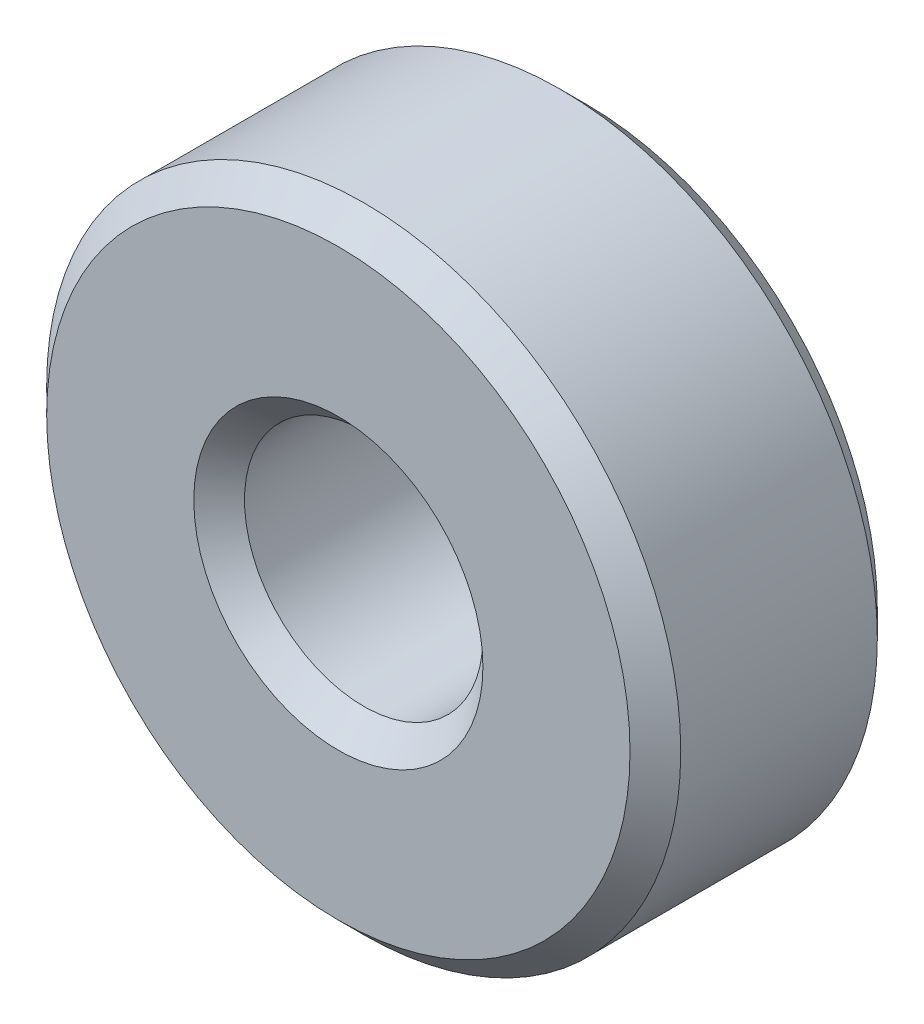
from build123d import *

# Parameters (mm, degrees)
SKETCH1_R                  = 6.35
SKETCH1_R_2                = 2.3876
R3_ZZ_ROLLER_BEARING_DEPTH = 4.953
CHAMFER1_SIZE              = 0.508


with BuildPart() as part:
    # Sketch1 → R3 ZZ Roller Bearing (new body)
    with BuildSketch(Plane.XY):
        Circle(SKETCH1_R)
        Circle(SKETCH1_R_2, mode=Mode.SUBTRACT)
    extrude(amount=R3_ZZ_ROLLER_BEARING_DEPTH)

    # Chamfer1
    chamfer1_edges = [part.edges().sort_by_distance(p)[0] for p in [
        (-6.35, 0, 0),
        (-6.35, 0, 4.953),
        (-2.3876, 0, 0),
        (-2.3876, 0, 4.953),
    ]]
    chamfer(chamfer1_edges, length=CHAMFER1_SIZE)


solid = part.part
